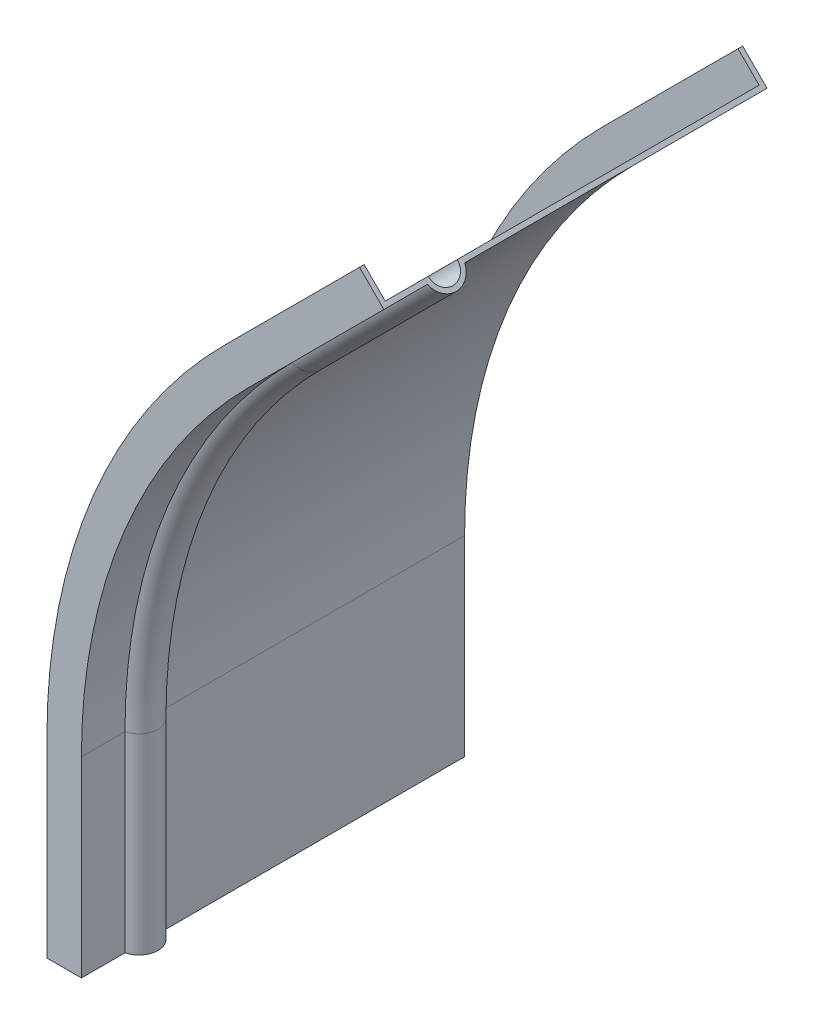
from build123d import *


with BuildPart() as part:
    # Sweep1: sweep along a path in Sketch1
    with BuildLine(Plane.XY) as sweep1_path:
        Line((500, 0), (500, 50))
        ThreePointArc((500, 50), (511.418070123, 107.402514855), (543.933982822, 156.066017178))
        Line((543.933982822, 156.066017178), (579.289321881, 191.421356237))
    # Sketch2 → Sweep1 (sweep)
    with BuildSketch(Plane(origin=(0, 0, 0), x_dir=(1, 0, 0), z_dir=(0, 1, 0))):
        with BuildLine():
            Line((501.214, 1.214), (492.214, 1.214))
            Line((492.214, 1.214), (492.214, 0))
            Line((492.214, 0), (500, 0))
            Line((500, 0), (500, -78.786))
            ThreePointArc((500, -78.786), (503.786, -82.572), (500, -86.358))
            Line((500, -86.358), (500, -97.572))
            Line((500, -97.572), (492.214, -97.572))
            Line((492.214, -97.572), (492.214, -98.786))
            Line((492.214, -98.786), (501.214, -98.786))
            Line((501.214, -98.786), (501.214, -87.422381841))
            ThreePointArc((501.214, -87.422381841), (505, -82.572), (501.214, -77.721618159))
            Line((501.214, -77.721618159), (501.214, 1.214))
        make_face()
    sweep(path=sweep1_path.line)


solid = part.part
